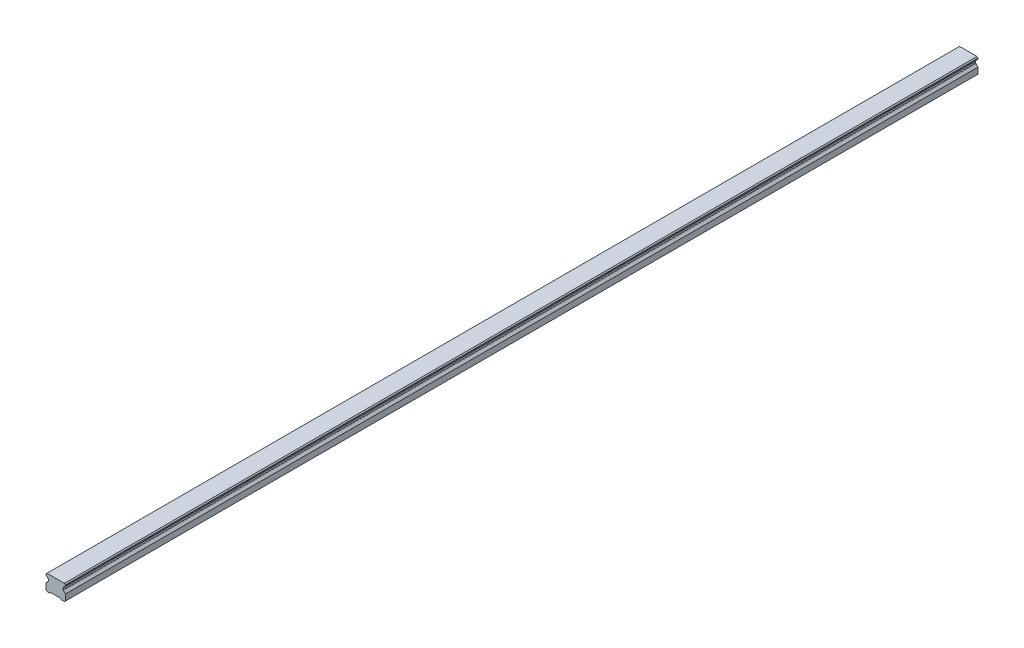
from build123d import *

# Parameters (mm, degrees)
SKETCH1_W           = 20
SKETCH1_H           = 16.3
BOSS_EXTRUDE1_DEPTH = 470
CUT_EXTRUDE1_DEPTH  = 941.194495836
CHAMFER1_SIZE       = 1
FILLET1_R           = 1
CUT_EXTRUDE2_DEPTH  = 941.194495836
SKETCH5_R           = 3
SKETCH5_R_2         = 2.5
CUT_EXTRUDE5_DEPTH  = 10
SKETCH5_2_R         = 2.5
CUT_EXTRUDE6_DEPTH  = 13
LPATTERN2_COUNT     = 16
LPATTERN2_PITCH     = 60


with BuildPart() as part:
    # Sketch1 → Boss-Extrude1 (new, symmetric)
    with BuildSketch(Plane.XY):
        with Locations((0, 8.15)):
            Rectangle(SKETCH1_W, SKETCH1_H)
    extrude(amount=BOSS_EXTRUDE1_DEPTH, both=True)

    # Sketch2 → Cut-Extrude1 (cut, through all)
    with BuildSketch(Plane.XY.offset(470)):
        Polygon((-10, 14.3), (-10, 7.3), (-7.666666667, 9.633333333), (-7.666666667, 11.966666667), align=None)
        Polygon((7.666666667, 11.966666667), (10, 14.3), (10, 7.3), (7.666666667, 9.633333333), align=None)
    extrude(amount=-CUT_EXTRUDE1_DEPTH, mode=Mode.SUBTRACT)

    # Chamfer1
    chamfer1_edges = [part.edges().sort_by_distance(p)[0] for p in [
        (-10, 16.3, 0),
        (10, 16.3, 0),
        (10, 0, 0),
        (-10, 0, 0),
    ]]
    chamfer(chamfer1_edges, length=CHAMFER1_SIZE)

    # Fillet1
    fillet1_edges = [part.edges().sort_by_distance(p)[0] for p in [
        (-7.666666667, 11.966666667, 0),
        (-7.666666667, 9.633333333, 0),
        (7.666666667, 9.633333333, 0),
        (7.666666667, 11.966666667, 0),
    ]]
    fillet(fillet1_edges, radius=FILLET1_R)

    # Sketch3 → Cut-Extrude2 (cut, through all)
    with BuildSketch(Plane.XY.offset(470)):
        Polygon((-6, 0), (-5, 1), (5, 1), (6, 0), align=None)
    extrude(amount=-CUT_EXTRUDE2_DEPTH, mode=Mode.SUBTRACT)

    # Sketch5 → Cut-Extrude5 (cut)
    with BuildSketch(Plane.XZ.offset(-1)):
        with Locations(Location((0, 450, 0), (0, 0, 270))):
            Circle(SKETCH5_R)
        with Locations(Location((0, 450, 0), (0, 0, 270))):
            Circle(SKETCH5_R_2, mode=Mode.SUBTRACT)
    cut_extrude5 = extrude(amount=-CUT_EXTRUDE5_DEPTH, mode=Mode.SUBTRACT)

    # Sketch5_2 → Cut-Extrude6 (cut)
    with BuildSketch(Plane.XZ.offset(-1)):
        with Locations(Location((0, 450, 0), (0, 0, 270))):
            Circle(SKETCH5_2_R)
    cut_extrude6 = extrude(amount=-CUT_EXTRUDE6_DEPTH, mode=Mode.SUBTRACT)

    # Cut-Extrude7 cone 1 section (on through the dimple's axis) → Cut-Extrude7 (revolve, cut)
    with BuildSketch(Plane(origin=(0, 14, 450), x_dir=(0, 0, -1), z_dir=(1, 0, 0))):
        Polygon((0, 0), (2.5, 0), (0, 1.443375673), align=None)
    cut_extrude7 = revolve(axis=Axis((0, 14, 450), (0, 1, 0)), mode=Mode.SUBTRACT)

    # LPattern2: Cut-Extrude5, Cut-Extrude6, Cut-Extrude7 ×16
    with Locations(*[(0, 0, -i * LPATTERN2_PITCH) for i in range(1, LPATTERN2_COUNT)]):
        add(cut_extrude5, mode=Mode.SUBTRACT)
        add(cut_extrude6, mode=Mode.SUBTRACT)
        add(cut_extrude7, mode=Mode.SUBTRACT)


solid = part.part
